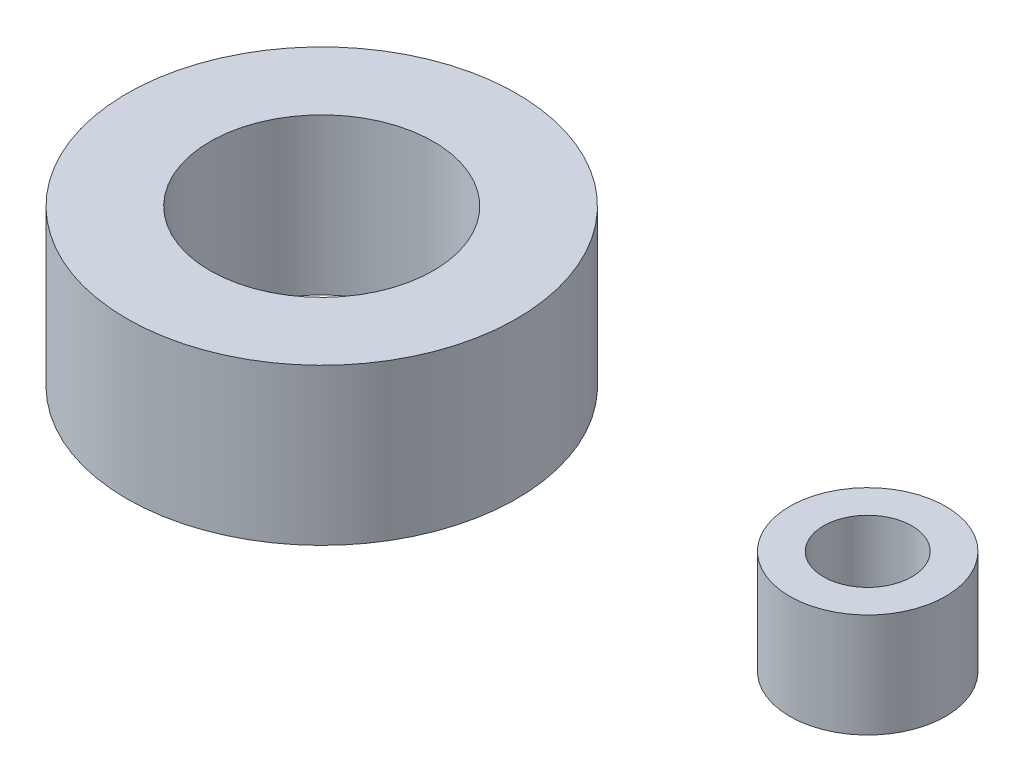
from build123d import *

# Parameters (mm, degrees)
SKETCH1_R      = 37.5
SKETCH1_R_2    = 21.5
EXTRUDE1_DEPTH = 15
SKETCH1_3_R    = 8.5
EXTRUDE2_DEPTH = 10


with BuildPart() as part:
    # Sketch1 → Extrude1 (new, symmetric)
    with BuildSketch(Plane(origin=(0, 0, 0), x_dir=(1, 0, 0), z_dir=(0, 1, 0))):
        with Locations(Location((0, 0, 0), (0, 0, 270))):
            Circle(SKETCH1_R)
        with Locations(Location((0, 0, 0), (0, 0, 270))):
            Circle(SKETCH1_R_2, mode=Mode.SUBTRACT)
    extrude(amount=EXTRUDE1_DEPTH, both=True)


with BuildPart() as body_2:
    # Sketch1_3 → Extrude2 (new, symmetric)
    with BuildSketch(Plane(origin=(0, 0, 0), x_dir=(1, 0, 0), z_dir=(0, 1, 0))):
        with BuildLine():
            ThreePointArc((120, 0), (116.687905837, 9.401747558), (108.214285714, 14.651565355))
            ThreePointArc((108.214285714, 14.651565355), (90, 0), (108.214285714, -14.651565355))
            ThreePointArc((108.214285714, -14.651565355), (116.687905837, -9.401747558), (120, 0))
        make_face()
        with Locations(Location((105, 0, 0), (0, 0, 270))):
            Circle(SKETCH1_3_R, mode=Mode.SUBTRACT)
    extrude(amount=EXTRUDE2_DEPTH, both=True)


solid = Compound([part.part, body_2.part])
